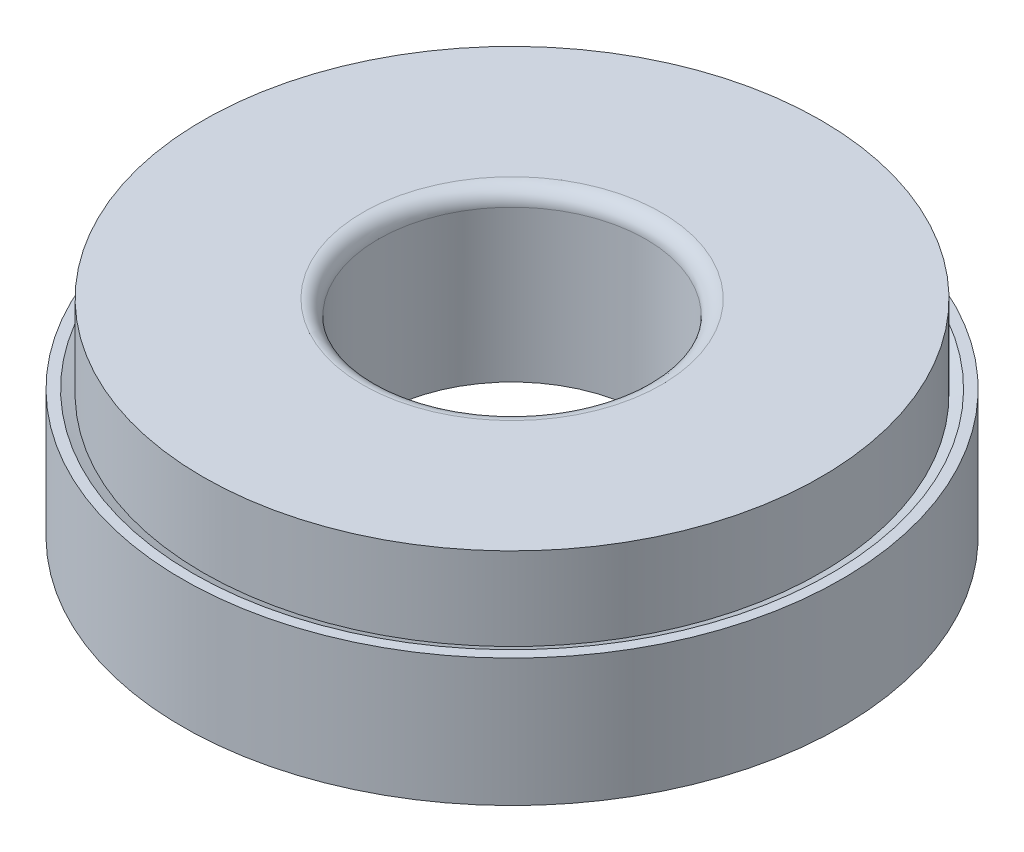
ISO-10303-21;
HEADER;
FILE_DESCRIPTION(('STEP AP214'),'2;1');
FILE_NAME('part.step','',(''),(''),'','','');
FILE_SCHEMA(('AUTOMOTIVE_DESIGN { 1 0 10303 214 1 1 1 1 }'));
ENDSEC;
DATA;
#1=APPLICATION_CONTEXT('core data for automotive mechanical design processes');
#2=APPLICATION_PROTOCOL_DEFINITION('international standard','automotive_design',2000,#1);
#3=PRODUCT_CONTEXT('',#1,'mechanical');
#4=PRODUCT('Part','Part','',(#3));
#5=PRODUCT_RELATED_PRODUCT_CATEGORY('part','',(#4));
#6=PRODUCT_DEFINITION_FORMATION('','',#4);
#7=PRODUCT_DEFINITION_CONTEXT('part definition',#1,'design');
#8=PRODUCT_DEFINITION('design','',#6,#7);
#9=PRODUCT_DEFINITION_SHAPE('','',#8);
#10=(LENGTH_UNIT() NAMED_UNIT(*) SI_UNIT(.MILLI.,.METRE.));
#11=(NAMED_UNIT(*) PLANE_ANGLE_UNIT() SI_UNIT($,.RADIAN.));
#12=(NAMED_UNIT(*) SI_UNIT($,.STERADIAN.) SOLID_ANGLE_UNIT());
#13=UNCERTAINTY_MEASURE_WITH_UNIT(LENGTH_MEASURE(1.E-05),#10,'distance_accuracy_value','');
#14=(GEOMETRIC_REPRESENTATION_CONTEXT(3) GLOBAL_UNCERTAINTY_ASSIGNED_CONTEXT((#13)) GLOBAL_UNIT_ASSIGNED_CONTEXT((#10,
#11,#12)) REPRESENTATION_CONTEXT('',''));
#15=CARTESIAN_POINT('',(0.,0.,0.));
#16=DIRECTION('',(0.,0.,1.));
#17=DIRECTION('',(1.,0.,0.));
#18=AXIS2_PLACEMENT_3D('',#15,#16,#17);
#19=CARTESIAN_POINT('',(0.,10.,0.));
#20=DIRECTION('',(0.,-1.,0.));
#21=DIRECTION('',(0.,0.,-1.));
#22=AXIS2_PLACEMENT_3D('',#19,#20,#21);
#23=CYLINDRICAL_SURFACE('',#22,15.);
#24=CARTESIAN_POINT('',(0.,5.97103465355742,0.));
#25=DIRECTION('',(0.,1.,0.));
#26=DIRECTION('',(0.,0.,1.));
#27=AXIS2_PLACEMENT_3D('',#24,#25,#26);
#28=CIRCLE('',#27,15.);
#29=CARTESIAN_POINT('',(0.,5.97103465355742,15.));
#30=VERTEX_POINT('',#29);
#31=EDGE_CURVE('P0_E29',#30,#30,#28,.T.);
#32=ORIENTED_EDGE('',*,*,#31,.T.);
#33=EDGE_LOOP('',(#32));
#34=FACE_BOUND('',#33,.T.);
#35=CARTESIAN_POINT('',(0.,10.,0.));
#36=DIRECTION('',(0.,1.,0.));
#37=DIRECTION('',(0.,0.,1.));
#38=AXIS2_PLACEMENT_3D('',#35,#36,#37);
#39=CIRCLE('',#38,15.);
#40=CARTESIAN_POINT('',(0.,10.,15.));
#41=VERTEX_POINT('',#40);
#42=EDGE_CURVE('P0_E25',#41,#41,#39,.T.);
#43=ORIENTED_EDGE('',*,*,#42,.F.);
#44=EDGE_LOOP('',(#43));
#45=FACE_BOUND('',#44,.T.);
#46=ADVANCED_FACE('P0_F14',(#34,#45),#23,.T.);
#47=CARTESIAN_POINT('',(0.,10.,0.));
#48=DIRECTION('',(0.,1.,0.));
#49=DIRECTION('',(0.,0.,1.));
#50=AXIS2_PLACEMENT_3D('',#47,#48,#49);
#51=PLANE('',#50);
#52=CARTESIAN_POINT('',(0.,10.,0.));
#53=DIRECTION('',(0.,1.,0.));
#54=DIRECTION('',(0.,0.,1.));
#55=AXIS2_PLACEMENT_3D('',#52,#53,#54);
#56=CIRCLE('',#55,7.25);
#57=CARTESIAN_POINT('',(0.,10.,7.25));
#58=VERTEX_POINT('',#57);
#59=EDGE_CURVE('P0_E21',#58,#58,#56,.F.);
#60=ORIENTED_EDGE('',*,*,#59,.T.);
#61=EDGE_LOOP('',(#60));
#62=FACE_BOUND('',#61,.T.);
#63=ORIENTED_EDGE('',*,*,#42,.T.);
#64=EDGE_LOOP('',(#63));
#65=FACE_BOUND('',#64,.T.);
#66=ADVANCED_FACE('P0_F92',(#62,#65),#51,.T.);
#67=CARTESIAN_POINT('',(0.,39.3874999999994,0.));
#68=DIRECTION('',(-1.,0.,0.));
#69=DIRECTION('',(0.,-1.,0.));
#70=AXIS2_PLACEMENT_3D('',#67,#68,#69);
#71=SPHERICAL_SURFACE('',#70,36.6286794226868);
#72=CARTESIAN_POINT('',(0.,39.3874999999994,0.));
#73=DIRECTION('',(0.,1.,0.));
#74=DIRECTION('',(0.,0.,1.));
#75=AXIS2_PLACEMENT_3D('',#72,#73,#74);
#76=SPHERICAL_SURFACE('',#75,36.6286794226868);
#77=CARTESIAN_POINT('',(0.,3.69999999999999,0.));
#78=DIRECTION('',(0.,1.,0.));
#79=DIRECTION('',(0.,0.,1.));
#80=AXIS2_PLACEMENT_3D('',#77,#78,#79);
#81=CIRCLE('',#80,8.25000000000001);
#82=CARTESIAN_POINT('',(0.,3.69999999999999,8.25000000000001));
#83=VERTEX_POINT('',#82);
#84=EDGE_CURVE('P0_E49',#83,#83,#81,.T.);
#85=ORIENTED_EDGE('',*,*,#84,.T.);
#86=EDGE_LOOP('',(#85));
#87=FACE_BOUND('',#86,.T.);
#88=ORIENTED_EDGE('',*,*,#31,.F.);
#89=EDGE_LOOP('',(#88));
#90=FACE_BOUND('',#89,.T.);
#91=ADVANCED_FACE('P0_F53',(#87,#90),#76,.T.);
#92=CARTESIAN_POINT('',(0.,1.9,0.));
#93=DIRECTION('',(0.,1.,0.));
#94=DIRECTION('',(0.,0.,1.));
#95=AXIS2_PLACEMENT_3D('',#92,#93,#94);
#96=CYLINDRICAL_SURFACE('',#95,8.25);
#97=CARTESIAN_POINT('',(0.,2.8,0.));
#98=DIRECTION('',(0.,1.,0.));
#99=DIRECTION('',(0.,0.,1.));
#100=AXIS2_PLACEMENT_3D('',#97,#98,#99);
#101=CIRCLE('',#100,8.25);
#102=CARTESIAN_POINT('',(0.,2.8,8.25));
#103=VERTEX_POINT('',#102);
#104=EDGE_CURVE('P0_E40',#103,#103,#101,.T.);
#105=ORIENTED_EDGE('',*,*,#104,.F.);
#106=EDGE_LOOP('',(#105));
#107=FACE_BOUND('',#106,.T.);
#108=CARTESIAN_POINT('',(0.,1.9,0.));
#109=DIRECTION('',(0.,1.,0.));
#110=DIRECTION('',(0.,0.,1.));
#111=AXIS2_PLACEMENT_3D('',#108,#109,#110);
#112=CIRCLE('',#111,8.25);
#113=CARTESIAN_POINT('',(0.,1.9,8.25));
#114=VERTEX_POINT('',#113);
#115=EDGE_CURVE('P0_E33',#114,#114,#112,.T.);
#116=ORIENTED_EDGE('',*,*,#115,.T.);
#117=EDGE_LOOP('',(#116));
#118=FACE_BOUND('',#117,.T.);
#119=ADVANCED_FACE('P0_F75',(#107,#118),#96,.T.);
#120=CARTESIAN_POINT('',(0.,1.9,0.));
#121=DIRECTION('',(0.,1.,0.));
#122=DIRECTION('',(0.,0.,1.));
#123=AXIS2_PLACEMENT_3D('',#120,#121,#122);
#124=PLANE('',#123);
#125=CARTESIAN_POINT('',(0.,1.9,0.));
#126=DIRECTION('',(0.,-1.,0.));
#127=DIRECTION('',(0.,0.,-1.));
#128=AXIS2_PLACEMENT_3D('',#125,#126,#127);
#129=CIRCLE('',#128,6.5);
#130=CARTESIAN_POINT('',(0.,1.9,-6.5));
#131=VERTEX_POINT('',#130);
#132=EDGE_CURVE('P0_E37',#131,#131,#129,.T.);
#133=ORIENTED_EDGE('',*,*,#132,.F.);
#134=EDGE_LOOP('',(#133));
#135=FACE_BOUND('',#134,.T.);
#136=ORIENTED_EDGE('',*,*,#115,.F.);
#137=EDGE_LOOP('',(#136));
#138=FACE_BOUND('',#137,.T.);
#139=ADVANCED_FACE('P0_F78',(#135,#138),#124,.F.);
#140=CARTESIAN_POINT('',(0.,10.,0.));
#141=DIRECTION('',(0.,-1.,0.));
#142=DIRECTION('',(0.,0.,-1.));
#143=AXIS2_PLACEMENT_3D('',#140,#141,#142);
#144=CYLINDRICAL_SURFACE('',#143,6.5);
#145=CARTESIAN_POINT('',(0.,9.25,0.));
#146=DIRECTION('',(0.,1.,0.));
#147=DIRECTION('',(0.,0.,1.));
#148=AXIS2_PLACEMENT_3D('',#145,#146,#147);
#149=CIRCLE('',#148,6.5);
#150=CARTESIAN_POINT('',(0.,9.25,6.5));
#151=VERTEX_POINT('',#150);
#152=EDGE_CURVE('P0_E10',#151,#151,#149,.T.);
#153=ORIENTED_EDGE('',*,*,#152,.T.);
#154=EDGE_LOOP('',(#153));
#155=FACE_BOUND('',#154,.T.);
#156=ORIENTED_EDGE('',*,*,#132,.T.);
#157=EDGE_LOOP('',(#156));
#158=FACE_BOUND('',#157,.T.);
#159=ADVANCED_FACE('P0_F71',(#155,#158),#144,.F.);
#160=CARTESIAN_POINT('',(-8.25,2.8,0.));
#161=DIRECTION('',(0.,-1.,0.));
#162=DIRECTION('',(0.,0.,-1.));
#163=AXIS2_PLACEMENT_3D('',#160,#161,#162);
#164=PLANE('',#163);
#165=CARTESIAN_POINT('',(0.,2.8,0.));
#166=DIRECTION('',(0.,1.,0.));
#167=DIRECTION('',(0.,0.,1.));
#168=AXIS2_PLACEMENT_3D('',#165,#166,#167);
#169=CIRCLE('',#168,7.375);
#170=CARTESIAN_POINT('',(0.,2.8,7.375));
#171=VERTEX_POINT('',#170);
#172=EDGE_CURVE('P0_E43',#171,#171,#169,.T.);
#173=ORIENTED_EDGE('',*,*,#172,.F.);
#174=EDGE_LOOP('',(#173));
#175=FACE_BOUND('',#174,.T.);
#176=ORIENTED_EDGE('',*,*,#104,.T.);
#177=EDGE_LOOP('',(#176));
#178=FACE_BOUND('',#177,.T.);
#179=ADVANCED_FACE('P0_F65',(#175,#178),#164,.F.);
#180=CARTESIAN_POINT('',(0.,10.,0.));
#181=DIRECTION('',(0.,1.,0.));
#182=DIRECTION('',(0.,0.,1.));
#183=AXIS2_PLACEMENT_3D('',#180,#181,#182);
#184=CYLINDRICAL_SURFACE('',#183,7.375);
#185=CARTESIAN_POINT('',(0.,3.69999999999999,0.));
#186=DIRECTION('',(0.,1.,0.));
#187=DIRECTION('',(0.,0.,1.));
#188=AXIS2_PLACEMENT_3D('',#185,#186,#187);
#189=CIRCLE('',#188,7.375);
#190=CARTESIAN_POINT('',(0.,3.69999999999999,7.375));
#191=VERTEX_POINT('',#190);
#192=EDGE_CURVE('P0_E46',#191,#191,#189,.T.);
#193=ORIENTED_EDGE('',*,*,#192,.F.);
#194=EDGE_LOOP('',(#193));
#195=FACE_BOUND('',#194,.T.);
#196=ORIENTED_EDGE('',*,*,#172,.T.);
#197=EDGE_LOOP('',(#196));
#198=FACE_BOUND('',#197,.T.);
#199=ADVANCED_FACE('P0_F59',(#195,#198),#184,.T.);
#200=CARTESIAN_POINT('',(-8.25000000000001,3.69999999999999,0.));
#201=DIRECTION('',(0.,1.,0.));
#202=DIRECTION('',(0.,0.,1.));
#203=AXIS2_PLACEMENT_3D('',#200,#201,#202);
#204=PLANE('',#203);
#205=ORIENTED_EDGE('',*,*,#84,.F.);
#206=EDGE_LOOP('',(#205));
#207=FACE_BOUND('',#206,.T.);
#208=ORIENTED_EDGE('',*,*,#192,.T.);
#209=EDGE_LOOP('',(#208));
#210=FACE_BOUND('',#209,.T.);
#211=ADVANCED_FACE('P0_F56',(#207,#210),#204,.F.);
#212=CARTESIAN_POINT('',(0.,9.25,0.));
#213=DIRECTION('',(0.,1.,0.));
#214=DIRECTION('',(0.,0.,1.));
#215=AXIS2_PLACEMENT_3D('',#212,#213,#214);
#216=TOROIDAL_SURFACE('',#215,7.25,0.75);
#217=ORIENTED_EDGE('',*,*,#152,.F.);
#218=EDGE_LOOP('',(#217));
#219=FACE_BOUND('',#218,.T.);
#220=ORIENTED_EDGE('',*,*,#59,.F.);
#221=EDGE_LOOP('',(#220));
#222=FACE_BOUND('',#221,.T.);
#223=ADVANCED_FACE('P0_F16',(#219,#222),#216,.T.);
#224=CLOSED_SHELL('',(#46,#66,#91,#119,#139,#159,#179,#199,#211,#223));
#225=MANIFOLD_SOLID_BREP('P0_B1',#224);
#226=CARTESIAN_POINT('',(0.,6.2,0.));
#227=DIRECTION('',(0.,-1.,0.));
#228=DIRECTION('',(0.,0.,-1.));
#229=AXIS2_PLACEMENT_3D('',#226,#227,#228);
#230=CYLINDRICAL_SURFACE('',#229,16.);
#231=CARTESIAN_POINT('',(0.,6.2,0.));
#232=DIRECTION('',(0.,1.,0.));
#233=DIRECTION('',(0.,0.,1.));
#234=AXIS2_PLACEMENT_3D('',#231,#232,#233);
#235=CIRCLE('',#234,16.);
#236=CARTESIAN_POINT('',(0.,6.2,-16.));
#237=VERTEX_POINT('',#236);
#238=EDGE_CURVE('P1_E9',#237,#237,#235,.T.);
#239=CARTESIAN_POINT('',(0.,0.,0.));
#240=DIRECTION('',(0.,1.,0.));
#241=DIRECTION('',(0.,0.,1.));
#242=AXIS2_PLACEMENT_3D('',#239,#240,#241);
#243=CIRCLE('',#242,16.);
#244=CARTESIAN_POINT('',(0.,0.,-16.));
#245=VERTEX_POINT('',#244);
#246=EDGE_CURVE('P1_E20',#245,#245,#243,.T.);
#247=CARTESIAN_POINT('',(0.,6.2,-16.));
#248=CARTESIAN_POINT('',(0.,6.13541666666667,-16.));
#249=CARTESIAN_POINT('',(0.,6.07083333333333,-16.));
#250=CARTESIAN_POINT('',(0.,5.94166666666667,-16.));
#251=CARTESIAN_POINT('',(0.,5.87708333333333,-16.));
#252=CARTESIAN_POINT('',(0.,5.74791666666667,-16.));
#253=CARTESIAN_POINT('',(0.,5.68333333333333,-16.));
#254=CARTESIAN_POINT('',(0.,5.55416666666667,-16.));
#255=CARTESIAN_POINT('',(0.,5.48958333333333,-16.));
#256=CARTESIAN_POINT('',(0.,5.36041666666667,-16.));
#257=CARTESIAN_POINT('',(0.,5.29583333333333,-16.));
#258=CARTESIAN_POINT('',(0.,5.16666666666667,-16.));
#259=CARTESIAN_POINT('',(0.,5.10208333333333,-16.));
#260=CARTESIAN_POINT('',(0.,4.97291666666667,-16.));
#261=CARTESIAN_POINT('',(0.,4.90833333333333,-16.));
#262=CARTESIAN_POINT('',(0.,4.77916666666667,-16.));
#263=CARTESIAN_POINT('',(0.,4.71458333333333,-16.));
#264=CARTESIAN_POINT('',(0.,4.58541666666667,-16.));
#265=CARTESIAN_POINT('',(0.,4.52083333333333,-16.));
#266=CARTESIAN_POINT('',(0.,4.39166666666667,-16.));
#267=CARTESIAN_POINT('',(0.,4.32708333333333,-16.));
#268=CARTESIAN_POINT('',(0.,4.19791666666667,-16.));
#269=CARTESIAN_POINT('',(0.,4.13333333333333,-16.));
#270=CARTESIAN_POINT('',(0.,4.00416666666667,-16.));
#271=CARTESIAN_POINT('',(0.,3.93958333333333,-16.));
#272=CARTESIAN_POINT('',(0.,3.81041666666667,-16.));
#273=CARTESIAN_POINT('',(0.,3.74583333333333,-16.));
#274=CARTESIAN_POINT('',(0.,3.61666666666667,-16.));
#275=CARTESIAN_POINT('',(0.,3.55208333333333,-16.));
#276=CARTESIAN_POINT('',(0.,3.42291666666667,-16.));
#277=CARTESIAN_POINT('',(0.,3.35833333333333,-16.));
#278=CARTESIAN_POINT('',(0.,3.22916666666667,-16.));
#279=CARTESIAN_POINT('',(0.,3.16458333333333,-16.));
#280=CARTESIAN_POINT('',(0.,3.03541666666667,-16.));
#281=CARTESIAN_POINT('',(0.,2.97083333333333,-16.));
#282=CARTESIAN_POINT('',(0.,2.84166666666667,-16.));
#283=CARTESIAN_POINT('',(0.,2.77708333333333,-16.));
#284=CARTESIAN_POINT('',(0.,2.64791666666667,-16.));
#285=CARTESIAN_POINT('',(0.,2.58333333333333,-16.));
#286=CARTESIAN_POINT('',(0.,2.45416666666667,-16.));
#287=CARTESIAN_POINT('',(0.,2.38958333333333,-16.));
#288=CARTESIAN_POINT('',(0.,2.26041666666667,-16.));
#289=CARTESIAN_POINT('',(0.,2.19583333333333,-16.));
#290=CARTESIAN_POINT('',(0.,2.06666666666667,-16.));
#291=CARTESIAN_POINT('',(0.,2.00208333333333,-16.));
#292=CARTESIAN_POINT('',(0.,1.87291666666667,-16.));
#293=CARTESIAN_POINT('',(0.,1.80833333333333,-16.));
#294=CARTESIAN_POINT('',(0.,1.67916666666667,-16.));
#295=CARTESIAN_POINT('',(0.,1.61458333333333,-16.));
#296=CARTESIAN_POINT('',(0.,1.48541666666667,-16.));
#297=CARTESIAN_POINT('',(0.,1.42083333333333,-16.));
#298=CARTESIAN_POINT('',(0.,1.29166666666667,-16.));
#299=CARTESIAN_POINT('',(0.,1.22708333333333,-16.));
#300=CARTESIAN_POINT('',(0.,1.09791666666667,-16.));
#301=CARTESIAN_POINT('',(0.,1.03333333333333,-16.));
#302=CARTESIAN_POINT('',(0.,0.904166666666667,-16.));
#303=CARTESIAN_POINT('',(0.,0.839583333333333,-16.));
#304=CARTESIAN_POINT('',(0.,0.710416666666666,-16.));
#305=CARTESIAN_POINT('',(0.,0.645833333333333,-16.));
#306=CARTESIAN_POINT('',(0.,0.516666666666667,-16.));
#307=CARTESIAN_POINT('',(0.,0.452083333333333,-16.));
#308=CARTESIAN_POINT('',(0.,0.322916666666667,-16.));
#309=CARTESIAN_POINT('',(0.,0.258333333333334,-16.));
#310=CARTESIAN_POINT('',(0.,0.129166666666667,-16.));
#311=CARTESIAN_POINT('',(0.,0.0645833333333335,-16.));
#312=CARTESIAN_POINT('',(0.,0.,-16.));
#313=B_SPLINE_CURVE_WITH_KNOTS('',3,(#247,#248,#249,#250,#251,#252,#253,#254,#255,#256,#257,
#258,#259,#260,#261,#262,#263,#264,#265,#266,#267,#268,#269,#270,#271,#272,#273,#274,#275,#276,
#277,#278,#279,#280,#281,#282,#283,#284,#285,#286,#287,#288,#289,#290,#291,#292,#293,#294,#295,
#296,#297,#298,#299,#300,#301,#302,#303,#304,#305,#306,#307,#308,#309,#310,#311,#312),
.UNSPECIFIED.,.F.,.F.,(4,2,2,2,2,2,2,2,2,2,2,2,2,2,2,2,2,2,2,2,2,2,2,2,2,2,2,2,2,2,2,2,4),(0.,
0.19375,0.387500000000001,0.58125,0.775,0.96875,1.1625,1.35625,1.55,1.74375,1.9375,2.13125,
2.325,2.51875,2.7125,2.90625,3.1,3.29375,3.4875,3.68125,3.875,4.06875,4.2625,4.45625,4.65,
4.84375,5.0375,5.23125,5.425,5.61875,5.8125,6.00625,6.2),.UNSPECIFIED.);
#314=EDGE_CURVE('P1_BSEAM13',#237,#245,#313,.T.);
#315=ORIENTED_EDGE('',*,*,#238,.F.);
#316=ORIENTED_EDGE('',*,*,#246,.T.);
#317=ORIENTED_EDGE('',*,*,#314,.T.);
#318=ORIENTED_EDGE('',*,*,#314,.F.);
#319=EDGE_LOOP('',(#315,#317,#316,#318));
#320=FACE_BOUND('',#319,.T.);
#321=ADVANCED_FACE('P1_F13',(#320),#230,.T.);
#322=CARTESIAN_POINT('',(0.,6.2,0.));
#323=DIRECTION('',(0.,1.,0.));
#324=DIRECTION('',(0.,0.,1.));
#325=AXIS2_PLACEMENT_3D('',#322,#323,#324);
#326=PLANE('',#325);
#327=CARTESIAN_POINT('',(0.,6.2,0.));
#328=DIRECTION('',(0.,1.,0.));
#329=DIRECTION('',(0.,0.,1.));
#330=AXIS2_PLACEMENT_3D('',#327,#328,#329);
#331=CIRCLE('',#330,15.5);
#332=CARTESIAN_POINT('',(0.,6.2,15.5));
#333=VERTEX_POINT('',#332);
#334=EDGE_CURVE('P1_E35',#333,#333,#331,.T.);
#335=ORIENTED_EDGE('',*,*,#334,.F.);
#336=EDGE_LOOP('',(#335));
#337=FACE_BOUND('',#336,.T.);
#338=ORIENTED_EDGE('',*,*,#238,.T.);
#339=EDGE_LOOP('',(#338));
#340=FACE_BOUND('',#339,.T.);
#341=ADVANCED_FACE('P1_F55',(#337,#340),#326,.T.);
#342=CARTESIAN_POINT('',(0.,0.,0.));
#343=DIRECTION('',(0.,1.,0.));
#344=DIRECTION('',(0.,0.,1.));
#345=AXIS2_PLACEMENT_3D('',#342,#343,#344);
#346=PLANE('',#345);
#347=CARTESIAN_POINT('',(0.,0.,0.));
#348=DIRECTION('',(0.,-1.,0.));
#349=DIRECTION('',(0.,0.,-1.));
#350=AXIS2_PLACEMENT_3D('',#347,#348,#349);
#351=CIRCLE('',#350,10.);
#352=CARTESIAN_POINT('',(0.,0.,-10.));
#353=VERTEX_POINT('',#352);
#354=EDGE_CURVE('P1_E27',#353,#353,#351,.T.);
#355=ORIENTED_EDGE('',*,*,#354,.F.);
#356=EDGE_LOOP('',(#355));
#357=FACE_BOUND('',#356,.T.);
#358=ORIENTED_EDGE('',*,*,#246,.F.);
#359=EDGE_LOOP('',(#358));
#360=FACE_BOUND('',#359,.T.);
#361=ADVANCED_FACE('P1_F60',(#357,#360),#346,.F.);
#362=CARTESIAN_POINT('',(0.,3.1,0.));
#363=DIRECTION('',(0.,-1.,0.));
#364=DIRECTION('',(0.,0.,-1.));
#365=AXIS2_PLACEMENT_3D('',#362,#363,#364);
#366=CYLINDRICAL_SURFACE('',#365,10.);
#367=CARTESIAN_POINT('',(0.,3.1,0.));
#368=DIRECTION('',(0.,-1.,0.));
#369=DIRECTION('',(0.,0.,-1.));
#370=AXIS2_PLACEMENT_3D('',#367,#368,#369);
#371=CIRCLE('',#370,10.);
#372=CARTESIAN_POINT('',(0.,3.1,-10.));
#373=VERTEX_POINT('',#372);
#374=EDGE_CURVE('P1_E25',#373,#373,#371,.T.);
#375=CARTESIAN_POINT('',(0.,3.1,-10.));
#376=CARTESIAN_POINT('',(0.,3.06770833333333,-10.));
#377=CARTESIAN_POINT('',(0.,3.03541666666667,-10.));
#378=CARTESIAN_POINT('',(0.,2.97083333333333,-10.));
#379=CARTESIAN_POINT('',(0.,2.93854166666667,-10.));
#380=CARTESIAN_POINT('',(0.,2.87395833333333,-10.));
#381=CARTESIAN_POINT('',(0.,2.84166666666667,-10.));
#382=CARTESIAN_POINT('',(0.,2.77708333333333,-10.));
#383=CARTESIAN_POINT('',(0.,2.74479166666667,-10.));
#384=CARTESIAN_POINT('',(0.,2.68020833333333,-10.));
#385=CARTESIAN_POINT('',(0.,2.64791666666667,-10.));
#386=CARTESIAN_POINT('',(0.,2.58333333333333,-10.));
#387=CARTESIAN_POINT('',(0.,2.55104166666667,-10.));
#388=CARTESIAN_POINT('',(0.,2.48645833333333,-10.));
#389=CARTESIAN_POINT('',(0.,2.45416666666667,-10.));
#390=CARTESIAN_POINT('',(0.,2.38958333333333,-10.));
#391=CARTESIAN_POINT('',(0.,2.35729166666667,-10.));
#392=CARTESIAN_POINT('',(0.,2.29270833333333,-10.));
#393=CARTESIAN_POINT('',(0.,2.26041666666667,-10.));
#394=CARTESIAN_POINT('',(0.,2.19583333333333,-10.));
#395=CARTESIAN_POINT('',(0.,2.16354166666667,-10.));
#396=CARTESIAN_POINT('',(0.,2.09895833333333,-10.));
#397=CARTESIAN_POINT('',(0.,2.06666666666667,-10.));
#398=CARTESIAN_POINT('',(0.,2.00208333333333,-10.));
#399=CARTESIAN_POINT('',(0.,1.96979166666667,-10.));
#400=CARTESIAN_POINT('',(0.,1.90520833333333,-10.));
#401=CARTESIAN_POINT('',(0.,1.87291666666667,-10.));
#402=CARTESIAN_POINT('',(0.,1.80833333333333,-10.));
#403=CARTESIAN_POINT('',(0.,1.77604166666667,-10.));
#404=CARTESIAN_POINT('',(0.,1.71145833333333,-10.));
#405=CARTESIAN_POINT('',(0.,1.67916666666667,-10.));
#406=CARTESIAN_POINT('',(0.,1.61458333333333,-10.));
#407=CARTESIAN_POINT('',(0.,1.58229166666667,-10.));
#408=CARTESIAN_POINT('',(0.,1.51770833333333,-10.));
#409=CARTESIAN_POINT('',(0.,1.48541666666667,-10.));
#410=CARTESIAN_POINT('',(0.,1.42083333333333,-10.));
#411=CARTESIAN_POINT('',(0.,1.38854166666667,-10.));
#412=CARTESIAN_POINT('',(0.,1.32395833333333,-10.));
#413=CARTESIAN_POINT('',(0.,1.29166666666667,-10.));
#414=CARTESIAN_POINT('',(0.,1.22708333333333,-10.));
#415=CARTESIAN_POINT('',(0.,1.19479166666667,-10.));
#416=CARTESIAN_POINT('',(0.,1.13020833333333,-10.));
#417=CARTESIAN_POINT('',(0.,1.09791666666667,-10.));
#418=CARTESIAN_POINT('',(0.,1.03333333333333,-10.));
#419=CARTESIAN_POINT('',(0.,1.00104166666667,-10.));
#420=CARTESIAN_POINT('',(0.,0.936458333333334,-10.));
#421=CARTESIAN_POINT('',(0.,0.904166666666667,-10.));
#422=CARTESIAN_POINT('',(0.,0.839583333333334,-10.));
#423=CARTESIAN_POINT('',(0.,0.807291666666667,-10.));
#424=CARTESIAN_POINT('',(0.,0.742708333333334,-10.));
#425=CARTESIAN_POINT('',(0.,0.710416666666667,-10.));
#426=CARTESIAN_POINT('',(0.,0.645833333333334,-10.));
#427=CARTESIAN_POINT('',(0.,0.613541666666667,-10.));
#428=CARTESIAN_POINT('',(0.,0.548958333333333,-10.));
#429=CARTESIAN_POINT('',(0.,0.516666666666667,-10.));
#430=CARTESIAN_POINT('',(0.,0.452083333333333,-10.));
#431=CARTESIAN_POINT('',(0.,0.419791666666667,-10.));
#432=CARTESIAN_POINT('',(0.,0.355208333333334,-10.));
#433=CARTESIAN_POINT('',(0.,0.322916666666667,-10.));
#434=CARTESIAN_POINT('',(0.,0.258333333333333,-10.));
#435=CARTESIAN_POINT('',(0.,0.226041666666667,-10.));
#436=CARTESIAN_POINT('',(0.,0.161458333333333,-10.));
#437=CARTESIAN_POINT('',(0.,0.129166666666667,-10.));
#438=CARTESIAN_POINT('',(0.,0.0645833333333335,-10.));
#439=CARTESIAN_POINT('',(0.,0.0322916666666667,-10.));
#440=CARTESIAN_POINT('',(0.,0.,-10.));
#441=B_SPLINE_CURVE_WITH_KNOTS('',3,(#375,#376,#377,#378,#379,#380,#381,#382,#383,#384,#385,
#386,#387,#388,#389,#390,#391,#392,#393,#394,#395,#396,#397,#398,#399,#400,#401,#402,#403,#404,
#405,#406,#407,#408,#409,#410,#411,#412,#413,#414,#415,#416,#417,#418,#419,#420,#421,#422,#423,
#424,#425,#426,#427,#428,#429,#430,#431,#432,#433,#434,#435,#436,#437,#438,#439,#440),
.UNSPECIFIED.,.F.,.F.,(4,2,2,2,2,2,2,2,2,2,2,2,2,2,2,2,2,2,2,2,2,2,2,2,2,2,2,2,2,2,2,2,4),(0.,
0.0968750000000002,0.19375,0.290625,0.3875,0.484375,0.58125,0.678125,0.775,0.871875,0.96875,
1.065625,1.1625,1.259375,1.35625,1.453125,1.55,1.646875,1.74375,1.840625,1.9375,2.034375,
2.13125,2.228125,2.325,2.421875,2.51875,2.615625,2.7125,2.809375,2.90625,3.003125,3.1),.UNSPECIFIED.);
#442=EDGE_CURVE('P1_BSEAM67',#373,#353,#441,.T.);
#443=ORIENTED_EDGE('',*,*,#374,.F.);
#444=ORIENTED_EDGE('',*,*,#354,.T.);
#445=ORIENTED_EDGE('',*,*,#442,.T.);
#446=ORIENTED_EDGE('',*,*,#442,.F.);
#447=EDGE_LOOP('',(#443,#445,#444,#446));
#448=FACE_BOUND('',#447,.T.);
#449=ADVANCED_FACE('P1_F67',(#448),#366,.F.);
#450=CARTESIAN_POINT('',(0.,3.1,0.));
#451=DIRECTION('',(0.,-1.,0.));
#452=DIRECTION('',(0.,0.,-1.));
#453=AXIS2_PLACEMENT_3D('',#450,#451,#452);
#454=PLANE('',#453);
#455=CARTESIAN_POINT('',(0.,3.1,0.));
#456=DIRECTION('',(0.,-1.,0.));
#457=DIRECTION('',(0.,0.,-1.));
#458=AXIS2_PLACEMENT_3D('',#455,#456,#457);
#459=CIRCLE('',#458,8.25);
#460=CARTESIAN_POINT('',(0.,3.1,-8.25));
#461=VERTEX_POINT('',#460);
#462=EDGE_CURVE('P1_E30',#461,#461,#459,.T.);
#463=ORIENTED_EDGE('',*,*,#462,.F.);
#464=EDGE_LOOP('',(#463));
#465=FACE_BOUND('',#464,.T.);
#466=ORIENTED_EDGE('',*,*,#374,.T.);
#467=EDGE_LOOP('',(#466));
#468=FACE_BOUND('',#467,.T.);
#469=ADVANCED_FACE('P1_F52',(#465,#468),#454,.T.);
#470=CARTESIAN_POINT('',(0.,6.2,0.));
#471=DIRECTION('',(0.,-1.,0.));
#472=DIRECTION('',(0.,0.,-1.));
#473=AXIS2_PLACEMENT_3D('',#470,#471,#472);
#474=CYLINDRICAL_SURFACE('',#473,8.25);
#475=CARTESIAN_POINT('',(0.,3.69999999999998,0.));
#476=DIRECTION('',(0.,1.,0.));
#477=DIRECTION('',(0.,0.,1.));
#478=AXIS2_PLACEMENT_3D('',#475,#476,#477);
#479=CIRCLE('',#478,8.25);
#480=CARTESIAN_POINT('',(0.,3.69999999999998,-8.25));
#481=VERTEX_POINT('',#480);
#482=EDGE_CURVE('P1_E16',#481,#481,#479,.T.);
#483=CARTESIAN_POINT('',(0.,3.69999999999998,-8.25));
#484=CARTESIAN_POINT('',(0.,3.69374999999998,-8.25));
#485=CARTESIAN_POINT('',(0.,3.68749999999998,-8.25));
#486=CARTESIAN_POINT('',(0.,3.67499999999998,-8.25));
#487=CARTESIAN_POINT('',(0.,3.66874999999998,-8.25));
#488=CARTESIAN_POINT('',(0.,3.65624999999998,-8.25));
#489=CARTESIAN_POINT('',(0.,3.64999999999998,-8.25));
#490=CARTESIAN_POINT('',(0.,3.63749999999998,-8.25));
#491=CARTESIAN_POINT('',(0.,3.63124999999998,-8.25));
#492=CARTESIAN_POINT('',(0.,3.61874999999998,-8.25));
#493=CARTESIAN_POINT('',(0.,3.61249999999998,-8.25));
#494=CARTESIAN_POINT('',(0.,3.59999999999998,-8.25));
#495=CARTESIAN_POINT('',(0.,3.59374999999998,-8.25));
#496=CARTESIAN_POINT('',(0.,3.58124999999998,-8.25));
#497=CARTESIAN_POINT('',(0.,3.57499999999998,-8.25));
#498=CARTESIAN_POINT('',(0.,3.56249999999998,-8.25));
#499=CARTESIAN_POINT('',(0.,3.55624999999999,-8.25));
#500=CARTESIAN_POINT('',(0.,3.54374999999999,-8.25));
#501=CARTESIAN_POINT('',(0.,3.53749999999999,-8.25));
#502=CARTESIAN_POINT('',(0.,3.52499999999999,-8.25));
#503=CARTESIAN_POINT('',(0.,3.51874999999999,-8.25));
#504=CARTESIAN_POINT('',(0.,3.50624999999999,-8.25));
#505=CARTESIAN_POINT('',(0.,3.49999999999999,-8.25));
#506=CARTESIAN_POINT('',(0.,3.48749999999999,-8.25));
#507=CARTESIAN_POINT('',(0.,3.48124999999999,-8.25));
#508=CARTESIAN_POINT('',(0.,3.46874999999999,-8.25));
#509=CARTESIAN_POINT('',(0.,3.46249999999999,-8.25));
#510=CARTESIAN_POINT('',(0.,3.44999999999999,-8.25));
#511=CARTESIAN_POINT('',(0.,3.44374999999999,-8.25));
#512=CARTESIAN_POINT('',(0.,3.43124999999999,-8.25));
#513=CARTESIAN_POINT('',(0.,3.42499999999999,-8.25));
#514=CARTESIAN_POINT('',(0.,3.41249999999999,-8.25));
#515=CARTESIAN_POINT('',(0.,3.40624999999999,-8.25));
#516=CARTESIAN_POINT('',(0.,3.39374999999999,-8.25));
#517=CARTESIAN_POINT('',(0.,3.38749999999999,-8.25));
#518=CARTESIAN_POINT('',(0.,3.37499999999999,-8.25));
#519=CARTESIAN_POINT('',(0.,3.36874999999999,-8.25));
#520=CARTESIAN_POINT('',(0.,3.35624999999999,-8.25));
#521=CARTESIAN_POINT('',(0.,3.34999999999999,-8.25));
#522=CARTESIAN_POINT('',(0.,3.33749999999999,-8.25));
#523=CARTESIAN_POINT('',(0.,3.33124999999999,-8.25));
#524=CARTESIAN_POINT('',(0.,3.31874999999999,-8.25));
#525=CARTESIAN_POINT('',(0.,3.31249999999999,-8.25));
#526=CARTESIAN_POINT('',(0.,3.29999999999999,-8.25));
#527=CARTESIAN_POINT('',(0.,3.29374999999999,-8.25));
#528=CARTESIAN_POINT('',(0.,3.28124999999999,-8.25));
#529=CARTESIAN_POINT('',(0.,3.27499999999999,-8.25));
#530=CARTESIAN_POINT('',(0.,3.26249999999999,-8.25));
#531=CARTESIAN_POINT('',(0.,3.25624999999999,-8.25));
#532=CARTESIAN_POINT('',(0.,3.24375,-8.25));
#533=CARTESIAN_POINT('',(0.,3.2375,-8.25));
#534=CARTESIAN_POINT('',(0.,3.225,-8.25));
#535=CARTESIAN_POINT('',(0.,3.21875,-8.25));
#536=CARTESIAN_POINT('',(0.,3.20625,-8.25));
#537=CARTESIAN_POINT('',(0.,3.2,-8.25));
#538=CARTESIAN_POINT('',(0.,3.1875,-8.25));
#539=CARTESIAN_POINT('',(0.,3.18125,-8.25));
#540=CARTESIAN_POINT('',(0.,3.16875,-8.25));
#541=CARTESIAN_POINT('',(0.,3.1625,-8.25));
#542=CARTESIAN_POINT('',(0.,3.15,-8.25));
#543=CARTESIAN_POINT('',(0.,3.14375,-8.25));
#544=CARTESIAN_POINT('',(0.,3.13125,-8.25));
#545=CARTESIAN_POINT('',(0.,3.125,-8.25));
#546=CARTESIAN_POINT('',(0.,3.1125,-8.25));
#547=CARTESIAN_POINT('',(0.,3.10625,-8.25));
#548=CARTESIAN_POINT('',(0.,3.1,-8.25));
#549=B_SPLINE_CURVE_WITH_KNOTS('',3,(#483,#484,#485,#486,#487,#488,#489,#490,#491,#492,#493,
#494,#495,#496,#497,#498,#499,#500,#501,#502,#503,#504,#505,#506,#507,#508,#509,#510,#511,#512,
#513,#514,#515,#516,#517,#518,#519,#520,#521,#522,#523,#524,#525,#526,#527,#528,#529,#530,#531,
#532,#533,#534,#535,#536,#537,#538,#539,#540,#541,#542,#543,#544,#545,#546,#547,#548),
.UNSPECIFIED.,.F.,.F.,(4,2,2,2,2,2,2,2,2,2,2,2,2,2,2,2,2,2,2,2,2,2,2,2,2,2,2,2,2,2,2,2,4),(0.,
0.0187499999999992,0.0374999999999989,0.0562499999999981,0.0749999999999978,0.093749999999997,
0.112499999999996,0.131249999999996,0.149999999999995,0.168749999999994,0.187499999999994,
0.206249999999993,0.224999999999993,0.243749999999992,0.262499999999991,0.281249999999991,
0.29999999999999,0.31874999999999,0.337499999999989,0.356249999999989,0.374999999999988,
0.393749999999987,0.412499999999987,0.431249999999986,0.449999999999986,0.468749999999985,
0.487499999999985,0.506249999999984,0.524999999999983,0.543749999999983,0.562499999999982,
0.581249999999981,0.599999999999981),.UNSPECIFIED.);
#550=EDGE_CURVE('P1_BSEAM42',#481,#461,#549,.T.);
#551=ORIENTED_EDGE('',*,*,#482,.T.);
#552=ORIENTED_EDGE('',*,*,#462,.T.);
#553=ORIENTED_EDGE('',*,*,#550,.T.);
#554=ORIENTED_EDGE('',*,*,#550,.F.);
#555=EDGE_LOOP('',(#551,#553,#552,#554));
#556=FACE_BOUND('',#555,.T.);
#557=ADVANCED_FACE('P1_F42',(#556),#474,.F.);
#558=CARTESIAN_POINT('',(0.,39.3875,0.));
#559=DIRECTION('',(-1.,0.,0.));
#560=DIRECTION('',(0.,1.,0.));
#561=AXIS2_PLACEMENT_3D('',#558,#559,#560);
#562=SPHERICAL_SURFACE('',#561,36.6286794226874);
#563=CARTESIAN_POINT('',(0.,39.3875,0.));
#564=DIRECTION('',(0.,1.,0.));
#565=DIRECTION('',(0.,0.,1.));
#566=AXIS2_PLACEMENT_3D('',#563,#564,#565);
#567=SPHERICAL_SURFACE('',#566,36.6286794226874);
#568=ORIENTED_EDGE('',*,*,#334,.T.);
#569=EDGE_LOOP('',(#568));
#570=FACE_BOUND('',#569,.T.);
#571=ORIENTED_EDGE('',*,*,#482,.F.);
#572=EDGE_LOOP('',(#571));
#573=FACE_BOUND('',#572,.T.);
#574=ADVANCED_FACE('P1_F45',(#570,#573),#567,.F.);
#575=CLOSED_SHELL('',(#321,#341,#361,#449,#469,#557,#574));
#576=MANIFOLD_SOLID_BREP('P1_B1',#575);
#577=ADVANCED_BREP_SHAPE_REPRESENTATION('',(#18,#225,#576),#14);
#578=SHAPE_DEFINITION_REPRESENTATION(#9,#577);
ENDSEC;
END-ISO-10303-21;
